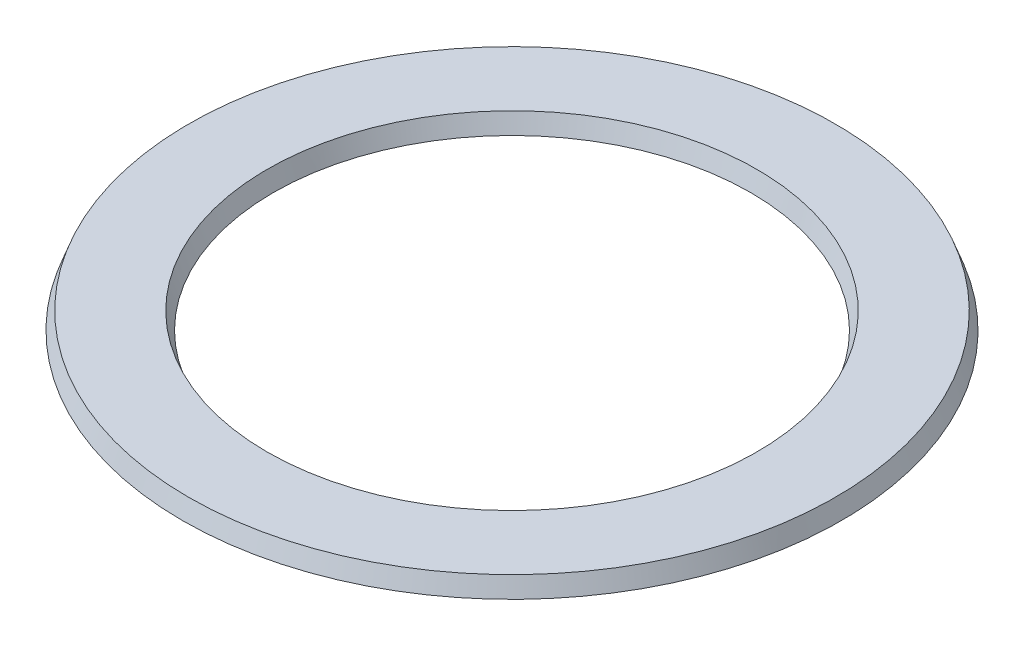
ISO-10303-21;
HEADER;
FILE_DESCRIPTION(('STEP AP214'),'2;1');
FILE_NAME('part.step','',(''),(''),'','','');
FILE_SCHEMA(('AUTOMOTIVE_DESIGN { 1 0 10303 214 1 1 1 1 }'));
ENDSEC;
DATA;
#1=APPLICATION_CONTEXT('core data for automotive mechanical design processes');
#2=APPLICATION_PROTOCOL_DEFINITION('international standard','automotive_design',2000,#1);
#3=PRODUCT_CONTEXT('',#1,'mechanical');
#4=PRODUCT('Part','Part','',(#3));
#5=PRODUCT_RELATED_PRODUCT_CATEGORY('part','',(#4));
#6=PRODUCT_DEFINITION_FORMATION('','',#4);
#7=PRODUCT_DEFINITION_CONTEXT('part definition',#1,'design');
#8=PRODUCT_DEFINITION('design','',#6,#7);
#9=PRODUCT_DEFINITION_SHAPE('','',#8);
#10=(LENGTH_UNIT() NAMED_UNIT(*) SI_UNIT(.MILLI.,.METRE.));
#11=(NAMED_UNIT(*) PLANE_ANGLE_UNIT() SI_UNIT($,.RADIAN.));
#12=(NAMED_UNIT(*) SI_UNIT($,.STERADIAN.) SOLID_ANGLE_UNIT());
#13=UNCERTAINTY_MEASURE_WITH_UNIT(LENGTH_MEASURE(1.E-05),#10,'distance_accuracy_value','');
#14=(GEOMETRIC_REPRESENTATION_CONTEXT(3) GLOBAL_UNCERTAINTY_ASSIGNED_CONTEXT((#13)) GLOBAL_UNIT_ASSIGNED_CONTEXT((#10,
#11,#12)) REPRESENTATION_CONTEXT('',''));
#15=CARTESIAN_POINT('',(0.,0.,0.));
#16=DIRECTION('',(0.,0.,1.));
#17=DIRECTION('',(1.,0.,0.));
#18=AXIS2_PLACEMENT_3D('',#15,#16,#17);
#19=CARTESIAN_POINT('',(0.,0.,0.));
#20=DIRECTION('',(0.,1.,0.));
#21=DIRECTION('',(0.,0.,1.));
#22=AXIS2_PLACEMENT_3D('',#19,#20,#21);
#23=CONICAL_SURFACE('',#22,21.,0.34906585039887);
#24=CARTESIAN_POINT('',(0.,1.5,0.));
#25=DIRECTION('',(0.,1.,0.));
#26=DIRECTION('',(0.,0.,1.));
#27=AXIS2_PLACEMENT_3D('',#24,#25,#26);
#28=CIRCLE('',#27,21.5459553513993);
#29=CARTESIAN_POINT('',(0.,1.5,21.5459553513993));
#30=VERTEX_POINT('',#29);
#31=EDGE_CURVE('E10',#30,#30,#28,.T.);
#32=ORIENTED_EDGE('',*,*,#31,.T.);
#33=EDGE_LOOP('',(#32));
#34=FACE_BOUND('',#33,.T.);
#35=CARTESIAN_POINT('',(0.,0.,0.));
#36=DIRECTION('',(0.,1.,0.));
#37=DIRECTION('',(0.,0.,1.));
#38=AXIS2_PLACEMENT_3D('',#35,#36,#37);
#39=CIRCLE('',#38,21.);
#40=CARTESIAN_POINT('',(0.,0.,21.));
#41=VERTEX_POINT('',#40);
#42=EDGE_CURVE('E38',#41,#41,#39,.T.);
#43=ORIENTED_EDGE('',*,*,#42,.F.);
#44=EDGE_LOOP('',(#43));
#45=FACE_BOUND('',#44,.T.);
#46=ADVANCED_FACE('F24',(#34,#45),#23,.F.);
#47=CARTESIAN_POINT('',(-28.4540446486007,1.5,0.));
#48=DIRECTION('',(0.,1.,0.));
#49=DIRECTION('',(0.,0.,1.));
#50=AXIS2_PLACEMENT_3D('',#47,#48,#49);
#51=PLANE('',#50);
#52=CARTESIAN_POINT('',(0.,1.5,0.));
#53=DIRECTION('',(0.,1.,0.));
#54=DIRECTION('',(0.,0.,1.));
#55=AXIS2_PLACEMENT_3D('',#52,#53,#54);
#56=CIRCLE('',#55,28.4540446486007);
#57=CARTESIAN_POINT('',(0.,1.5,28.4540446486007));
#58=VERTEX_POINT('',#57);
#59=EDGE_CURVE('E30',#58,#58,#56,.T.);
#60=ORIENTED_EDGE('',*,*,#59,.T.);
#61=EDGE_LOOP('',(#60));
#62=FACE_BOUND('',#61,.T.);
#63=ORIENTED_EDGE('',*,*,#31,.F.);
#64=EDGE_LOOP('',(#63));
#65=FACE_BOUND('',#64,.T.);
#66=ADVANCED_FACE('F48',(#62,#65),#51,.T.);
#67=CARTESIAN_POINT('',(0.,1.5,0.));
#68=DIRECTION('',(0.,-1.,0.));
#69=DIRECTION('',(0.,0.,-1.));
#70=AXIS2_PLACEMENT_3D('',#67,#68,#69);
#71=CONICAL_SURFACE('',#70,28.4540446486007,0.34906585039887);
#72=CARTESIAN_POINT('',(0.,0.,0.));
#73=DIRECTION('',(0.,1.,0.));
#74=DIRECTION('',(0.,0.,1.));
#75=AXIS2_PLACEMENT_3D('',#72,#73,#74);
#76=CIRCLE('',#75,29.);
#77=CARTESIAN_POINT('',(0.,0.,29.));
#78=VERTEX_POINT('',#77);
#79=EDGE_CURVE('E34',#78,#78,#76,.T.);
#80=ORIENTED_EDGE('',*,*,#79,.T.);
#81=EDGE_LOOP('',(#80));
#82=FACE_BOUND('',#81,.T.);
#83=ORIENTED_EDGE('',*,*,#59,.F.);
#84=EDGE_LOOP('',(#83));
#85=FACE_BOUND('',#84,.T.);
#86=ADVANCED_FACE('F52',(#82,#85),#71,.T.);
#87=CARTESIAN_POINT('',(-21.,0.,0.));
#88=DIRECTION('',(0.,-1.,0.));
#89=DIRECTION('',(0.,0.,-1.));
#90=AXIS2_PLACEMENT_3D('',#87,#88,#89);
#91=PLANE('',#90);
#92=ORIENTED_EDGE('',*,*,#42,.T.);
#93=EDGE_LOOP('',(#92));
#94=FACE_BOUND('',#93,.T.);
#95=ORIENTED_EDGE('',*,*,#79,.F.);
#96=EDGE_LOOP('',(#95));
#97=FACE_BOUND('',#96,.T.);
#98=ADVANCED_FACE('F44',(#94,#97),#91,.T.);
#99=CLOSED_SHELL('',(#46,#66,#86,#98));
#100=MANIFOLD_SOLID_BREP('B2',#99);
#101=ADVANCED_BREP_SHAPE_REPRESENTATION('',(#18,#100),#14);
#102=SHAPE_DEFINITION_REPRESENTATION(#9,#101);
ENDSEC;
END-ISO-10303-21;
